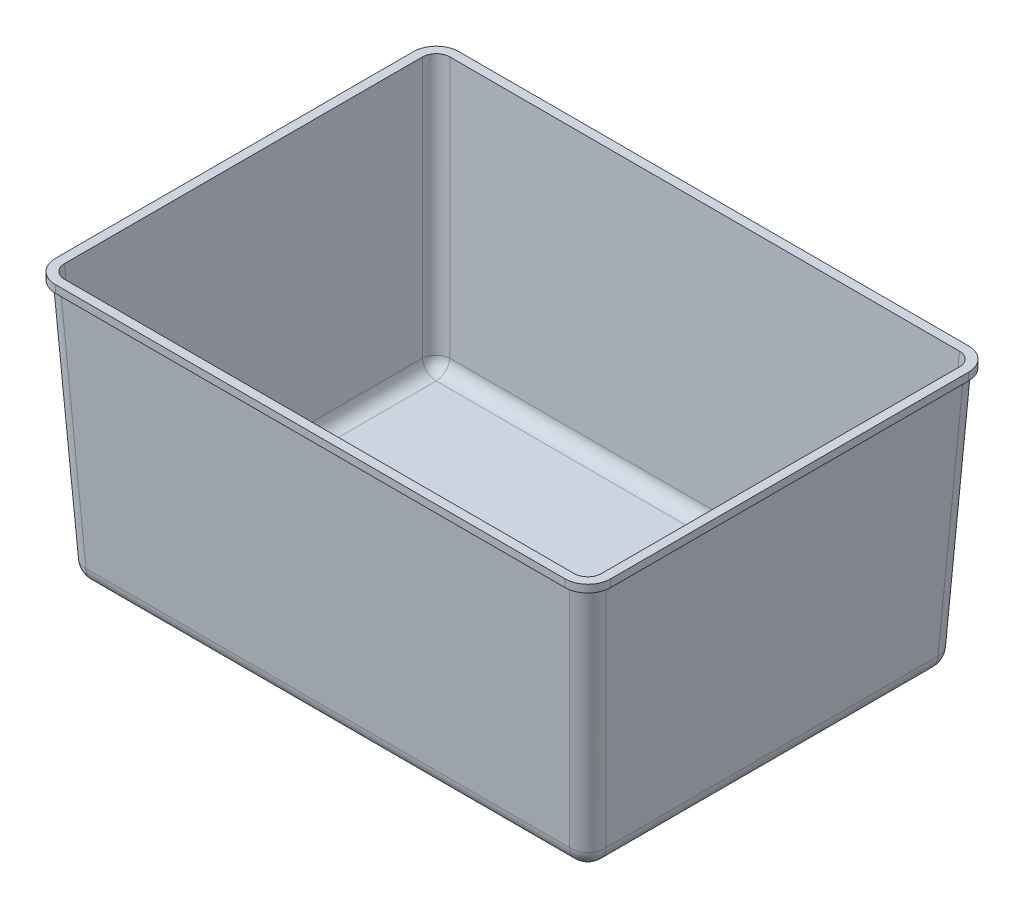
from build123d import *

# Parameters (mm, degrees)
ESQUISSE1_W      = 360
ESQUISSE1_H      = 260
EXTRUSION1_DEPTH = 175
EXTRUSION1_DRAFT = -3
CONG_1_R         = 12
COQUE1_T         = -3
EXTRUSION5_DEPTH = 5


with BuildPart() as part:
    # Esquisse1 → Extrusion1 (with draft: the straight prism first)
    with BuildSketch(Plane(origin=(0, 0, 0), x_dir=(1, 0, 0), z_dir=(0, 1, 0))):
        with Locations((180, 130)):
            Rectangle(ESQUISSE1_W, ESQUISSE1_H)
    extrude(amount=-EXTRUSION1_DEPTH)
    # Extrusion1: the draft: its side faces are tilted about the plane it starts from
    extrusion1_sides = [part.faces().sort_by_distance(p)[0] for p in [
        (180, -87.5, 0),
        (360, -87.5, -130),
        (180, -87.5, -260),
        (0, -87.5, -130),
    ]]
    draft(extrusion1_sides, Plane(origin=(0, 0, 0), x_dir=(1, 0, 0), z_dir=(0, 1, 0)), EXTRUSION1_DRAFT)

    # Cong_1
    cong_1_edges = [part.edges().sort_by_distance(p)[0] for p in [
        (350.828638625, -175, -130),
        (180, -175, -250.828638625),
        (9.171361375, -175, -130),
        (180, -175, -9.171361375),
        (4.585680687, -87.5, -255.414319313),
        (355.414319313, -87.5, -255.414319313),
        (355.414319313, -87.5, -4.585680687),
        (4.585680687, -87.5, -4.585680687),
    ]]
    fillet(cong_1_edges, radius=CONG_1_R)

    # Coque1
    coque1_openings = [part.faces().sort_by_distance(p)[0] for p in [
        (180, 0, -130),
    ]]
    offset(amount=COQUE1_T, openings=coque1_openings, kind=Kind.INTERSECTION)

    # Esquisse3 → Extrusion5 (add)
    with BuildSketch(Plane(origin=(0, 0, 0), x_dir=(-1, 0, 0), z_dir=(0, 1, 0))):
        with BuildLine():
            Line((-363, -11.983554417), (-363, -248.016445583))
            add(Edge.make_bspline(
                [(-363, -248.016445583), (-363, -249.005600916), (-362.903211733, -249.979959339), (-362.617200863, -251.419967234), (-362.498222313, -251.896355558), (-362.211627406, -252.841696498), (-362.045390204, -253.305655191), (-361.483740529, -254.661187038), (-361.024542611, -255.521556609), (-360.207136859, -256.746386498), (-359.911440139, -257.145360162), (-359.288114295, -257.904878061), (-358.959693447, -258.26702488), (-357.925239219, -259.301766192), (-357.169810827, -259.923628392), (-355.525792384, -261.022635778), (-354.663394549, -261.482464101), (-353.311644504, -262.043088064), (-352.85129729, -262.208283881), (-351.910624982, -262.494318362), (-351.429238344, -262.615119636), (-349.982373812, -262.903206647), (-349.005604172, -263), (-348.016445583, -263)],
                knots=[0, 0, 0, 0, 0.125, 0.125, 0.1875, 0.1875, 0.25, 0.25, 0.375, 0.375, 0.4375, 0.4375, 0.5, 0.5, 0.625, 0.625, 0.75, 0.75, 0.8125, 0.8125, 0.875, 0.875, 1, 1, 1, 1], degree=3))
            Line((-348.016445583, -263), (-11.983554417, -263))
            add(Edge.make_bspline(
                [(-11.983554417, -263), (-10.994399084, -263), (-10.020040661, -262.903211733), (-8.580032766, -262.617200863), (-8.103644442, -262.498222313), (-7.158303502, -262.211627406), (-6.694344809, -262.045390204), (-5.338812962, -261.483740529), (-4.478443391, -261.024542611), (-3.253613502, -260.207136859), (-2.854639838, -259.911440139), (-2.095121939, -259.288114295), (-1.73297512, -258.959693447), (-0.698233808, -257.925239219), (-0.076371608, -257.169810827), (1.022635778, -255.525792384), (1.482464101, -254.663394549), (2.043088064, -253.311644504), (2.208283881, -252.85129729), (2.494318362, -251.910624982), (2.615119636, -251.429238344), (2.903206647, -249.982373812), (3, -249.005604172), (3, -248.016445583)],
                knots=[0, 0, 0, 0, 0.125, 0.125, 0.1875, 0.1875, 0.25, 0.25, 0.375, 0.375, 0.4375, 0.4375, 0.5, 0.5, 0.625, 0.625, 0.75, 0.75, 0.8125, 0.8125, 0.875, 0.875, 1, 1, 1, 1], degree=3))
            Line((3, -248.016445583), (3, -11.983554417))
            add(Edge.make_bspline(
                [(3, -11.983554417), (3, -10.994399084), (2.903211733, -10.020040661), (2.617200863, -8.580032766), (2.498222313, -8.103644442), (2.211627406, -7.158303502), (2.045390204, -6.694344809), (1.483740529, -5.338812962), (1.024542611, -4.478443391), (0.207136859, -3.253613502), (-0.088559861, -2.854639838), (-0.711885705, -2.095121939), (-1.040306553, -1.73297512), (-2.074760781, -0.698233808), (-2.830189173, -0.076371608), (-4.474207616, 1.022635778), (-5.336605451, 1.482464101), (-6.688355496, 2.043088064), (-7.14870271, 2.208283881), (-8.089375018, 2.494318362), (-8.570761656, 2.615119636), (-10.017626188, 2.903206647), (-10.994395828, 3), (-11.983554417, 3)],
                knots=[0, 0, 0, 0, 0.125, 0.125, 0.1875, 0.1875, 0.25, 0.25, 0.375, 0.375, 0.4375, 0.4375, 0.5, 0.5, 0.625, 0.625, 0.75, 0.75, 0.8125, 0.8125, 0.875, 0.875, 1, 1, 1, 1], degree=3))
            Line((-11.983554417, 3), (-348.016445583, 3))
            add(Edge.make_bspline(
                [(-348.016445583, 3), (-349.005600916, 3), (-349.979959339, 2.903211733), (-351.419967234, 2.617200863), (-351.896355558, 2.498222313), (-352.841696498, 2.211627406), (-353.305655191, 2.045390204), (-354.661187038, 1.483740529), (-355.521556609, 1.024542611), (-356.746386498, 0.207136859), (-357.145360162, -0.088559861), (-357.904878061, -0.711885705), (-358.26702488, -1.040306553), (-359.301766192, -2.074760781), (-359.923628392, -2.830189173), (-361.022635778, -4.474207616), (-361.482464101, -5.336605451), (-362.043088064, -6.688355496), (-362.208283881, -7.14870271), (-362.494318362, -8.089375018), (-362.615119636, -8.570761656), (-362.903206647, -10.017626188), (-363, -10.994395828), (-363, -11.983554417)],
                knots=[0, 0, 0, 0, 0.125, 0.125, 0.1875, 0.1875, 0.25, 0.25, 0.375, 0.375, 0.4375, 0.4375, 0.5, 0.5, 0.625, 0.625, 0.75, 0.75, 0.8125, 0.8125, 0.875, 0.875, 1, 1, 1, 1], degree=3))
        make_face()
        with BuildLine():
            Line((-356.995882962, -11.991782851), (-356.995882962, -248.008217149))
            add(Edge.make_bspline(
                [(-356.995882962, -248.008217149), (-356.995882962, -256.995882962), (-348.008217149, -256.995882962)],
                knots=[5.499156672, 5.499156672, 5.499156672, 7.067213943, 7.067213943, 7.067213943], degree=2, weights=[1, 0.70807452, 1]))
            Line((-348.008217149, -256.995882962), (-11.991782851, -256.995882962))
            add(Edge.make_bspline(
                [(-11.991782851, -256.995882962), (-3.004117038, -256.995882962), (-3.004117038, -248.008217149)],
                knots=[5.499156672, 5.499156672, 5.499156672, 7.067213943, 7.067213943, 7.067213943], degree=2, weights=[1, 0.70807452, 1]))
            Line((-3.004117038, -248.008217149), (-3.004117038, -11.991782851))
            add(Edge.make_bspline(
                [(-3.004117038, -11.991782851), (-3.004117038, -3.004117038), (-11.991782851, -3.004117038)],
                knots=[5.499156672, 5.499156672, 5.499156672, 7.067213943, 7.067213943, 7.067213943], degree=2, weights=[1, 0.70807452, 1]))
            Line((-11.991782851, -3.004117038), (-348.008217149, -3.004117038))
            add(Edge.make_bspline(
                [(-348.008217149, -3.004117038), (-356.995882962, -3.004117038), (-356.995882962, -11.991782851)],
                knots=[5.499156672, 5.499156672, 5.499156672, 7.067213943, 7.067213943, 7.067213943], degree=2, weights=[1, 0.70807452, 1]))
        make_face(mode=Mode.SUBTRACT)
    extrude(amount=-EXTRUSION5_DEPTH)


solid = part.part
